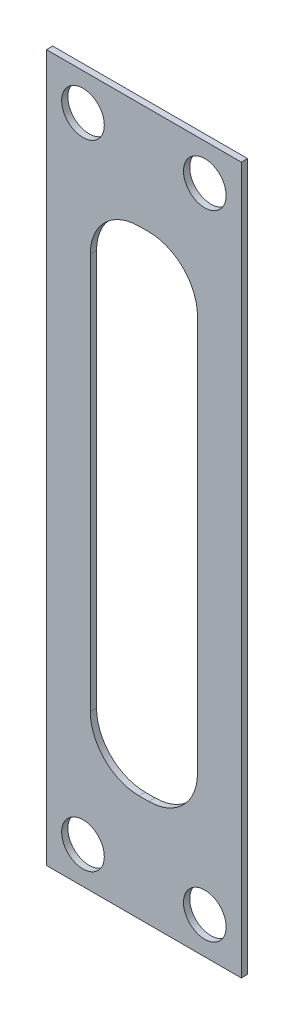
from build123d import *

# Parameters (mm, degrees)
SKETCH1_W                       = 25.4
SKETCH1_H                       = 92.075
EXTRUDE1_DEPTH                  = 0.4064
F_7_32_0_21875_DIAMETER_HOLE1_D = 5.55625


with BuildPart() as part:
    # Sketch1 → Extrude1 (new, symmetric)
    with BuildSketch(Plane.XY):
        Rectangle(SKETCH1_W, SKETCH1_H)
        with BuildLine():
            Line((-0.635, 32.1437), (0.635, 32.1437))
            ThreePointArc((0.635, 32.1437), (5.125128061, 30.283828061), (6.985, 25.7937))
            Line((6.985, 25.7937), (6.985, -25.7937))
            ThreePointArc((6.985, -25.7937), (5.125128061, -30.283828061), (0.635, -32.1437))
            Line((0.635, -32.1437), (-0.635, -32.1437))
            ThreePointArc((-0.635, -32.1437), (-5.125128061, -30.283828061), (-6.985, -25.7937))
            Line((-6.985, -25.7937), (-6.985, 25.7937))
            ThreePointArc((-6.985, 25.7937), (-5.125128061, 30.283828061), (-0.635, 32.1437))
        make_face(mode=Mode.SUBTRACT)
    extrude(amount=EXTRUDE1_DEPTH, both=True)

    # 7_32 _0.21875_ Diameter Hole1 (through all)
    with Locations(Plane.XY.offset(0.4064)):
        with Locations((-7.9375, 41.275), (7.9375, 41.275), (7.9375, -41.275), (-7.9375, -41.275)):
            Hole(F_7_32_0_21875_DIAMETER_HOLE1_D / 2)


solid = part.part
